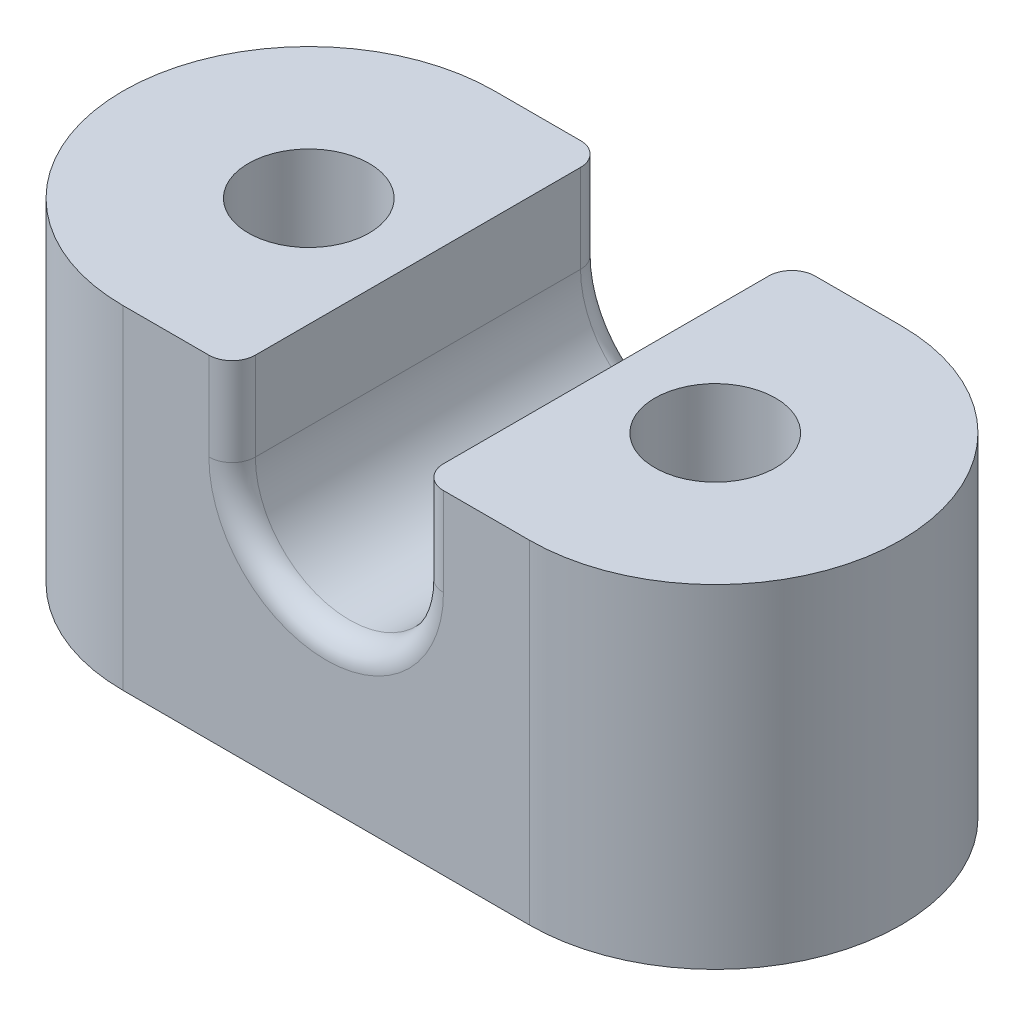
ISO-10303-21;
HEADER;
FILE_DESCRIPTION(('STEP AP214'),'2;1');
FILE_NAME('part.step','',(''),(''),'','','');
FILE_SCHEMA(('AUTOMOTIVE_DESIGN { 1 0 10303 214 1 1 1 1 }'));
ENDSEC;
DATA;
#1=APPLICATION_CONTEXT('core data for automotive mechanical design processes');
#2=APPLICATION_PROTOCOL_DEFINITION('international standard','automotive_design',2000,#1);
#3=PRODUCT_CONTEXT('',#1,'mechanical');
#4=PRODUCT('Part','Part','',(#3));
#5=PRODUCT_RELATED_PRODUCT_CATEGORY('part','',(#4));
#6=PRODUCT_DEFINITION_FORMATION('','',#4);
#7=PRODUCT_DEFINITION_CONTEXT('part definition',#1,'design');
#8=PRODUCT_DEFINITION('design','',#6,#7);
#9=PRODUCT_DEFINITION_SHAPE('','',#8);
#10=(LENGTH_UNIT() NAMED_UNIT(*) SI_UNIT(.MILLI.,.METRE.));
#11=(NAMED_UNIT(*) PLANE_ANGLE_UNIT() SI_UNIT($,.RADIAN.));
#12=(NAMED_UNIT(*) SI_UNIT($,.STERADIAN.) SOLID_ANGLE_UNIT());
#13=UNCERTAINTY_MEASURE_WITH_UNIT(LENGTH_MEASURE(1.E-05),#10,'distance_accuracy_value','');
#14=(GEOMETRIC_REPRESENTATION_CONTEXT(3) GLOBAL_UNCERTAINTY_ASSIGNED_CONTEXT((#13)) GLOBAL_UNIT_ASSIGNED_CONTEXT((#10,
#11,#12)) REPRESENTATION_CONTEXT('',''));
#15=CARTESIAN_POINT('',(0.,0.,0.));
#16=DIRECTION('',(0.,0.,1.));
#17=DIRECTION('',(1.,0.,0.));
#18=AXIS2_PLACEMENT_3D('',#15,#16,#17);
#19=CARTESIAN_POINT('',(-61.2681475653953,14.35,0.));
#20=DIRECTION('',(0.,1.,0.));
#21=DIRECTION('',(0.,0.,1.));
#22=AXIS2_PLACEMENT_3D('',#19,#20,#21);
#23=PLANE('',#22);
#24=DIRECTION('',(0.,0.,-1.));
#25=VECTOR('',#24,1.);
#26=CARTESIAN_POINT('',(-48.4681475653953,14.35,0.));
#27=LINE('',#26,#25);
#28=CARTESIAN_POINT('',(-48.4681475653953,14.35,7.));
#29=VERTEX_POINT('',#28);
#30=CARTESIAN_POINT('',(-48.4681475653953,14.35,-7.));
#31=VERTEX_POINT('',#30);
#32=EDGE_CURVE('E153',#29,#31,#27,.T.);
#33=ORIENTED_EDGE('',*,*,#32,.F.);
#34=CARTESIAN_POINT('',(-47.4681475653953,14.35,7.));
#35=DIRECTION('',(0.,1.,0.));
#36=DIRECTION('',(0.,0.,1.));
#37=AXIS2_PLACEMENT_3D('',#34,#35,#36);
#38=CIRCLE('',#37,1.);
#39=CARTESIAN_POINT('',(-47.4681475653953,14.35,8.));
#40=VERTEX_POINT('',#39);
#41=EDGE_CURVE('E205',#29,#40,#38,.T.);
#42=ORIENTED_EDGE('',*,*,#41,.T.);
#43=DIRECTION('',(1.,0.,0.));
#44=VECTOR('',#43,1.);
#45=CARTESIAN_POINT('',(-61.2681475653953,14.35,8.));
#46=LINE('',#45,#44);
#47=CARTESIAN_POINT('',(-43.7681475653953,14.35,8.));
#48=VERTEX_POINT('',#47);
#49=EDGE_CURVE('E134',#40,#48,#46,.T.);
#50=ORIENTED_EDGE('',*,*,#49,.T.);
#51=CARTESIAN_POINT('',(-43.7681475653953,14.35,0.));
#52=DIRECTION('',(0.,1.,0.));
#53=DIRECTION('',(0.,0.,1.));
#54=AXIS2_PLACEMENT_3D('',#51,#52,#53);
#55=CIRCLE('',#54,8.);
#56=CARTESIAN_POINT('',(-43.7681475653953,14.35,-8.));
#57=VERTEX_POINT('',#56);
#58=EDGE_CURVE('E133',#48,#57,#55,.T.);
#59=ORIENTED_EDGE('',*,*,#58,.T.);
#60=DIRECTION('',(-1.,0.,0.));
#61=VECTOR('',#60,1.);
#62=CARTESIAN_POINT('',(-61.2681475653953,14.35,-8.));
#63=LINE('',#62,#61);
#64=CARTESIAN_POINT('',(-47.4681475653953,14.35,-8.));
#65=VERTEX_POINT('',#64);
#66=EDGE_CURVE('E283',#57,#65,#63,.T.);
#67=ORIENTED_EDGE('',*,*,#66,.T.);
#68=CARTESIAN_POINT('',(-47.4681475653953,14.35,-7.));
#69=DIRECTION('',(0.,1.,0.));
#70=DIRECTION('',(0.,0.,1.));
#71=AXIS2_PLACEMENT_3D('',#68,#69,#70);
#72=CIRCLE('',#71,1.);
#73=EDGE_CURVE('E180',#65,#31,#72,.T.);
#74=ORIENTED_EDGE('',*,*,#73,.T.);
#75=EDGE_LOOP('',(#33,#42,#50,#59,#67,#74));
#76=FACE_BOUND('',#75,.T.);
#77=CARTESIAN_POINT('',(-43.7681475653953,14.35,0.));
#78=DIRECTION('',(0.,-1.,0.));
#79=DIRECTION('',(0.,0.,-1.));
#80=AXIS2_PLACEMENT_3D('',#77,#78,#79);
#81=CIRCLE('',#80,2.6);
#82=CARTESIAN_POINT('',(-43.7681475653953,14.35,-2.6));
#83=VERTEX_POINT('',#82);
#84=EDGE_CURVE('E163',#83,#83,#81,.T.);
#85=ORIENTED_EDGE('',*,*,#84,.T.);
#86=EDGE_LOOP('',(#85));
#87=FACE_BOUND('',#86,.T.);
#88=ADVANCED_FACE('F35',(#76,#87),#23,.T.);
#89=CARTESIAN_POINT('',(-61.2681475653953,14.35,0.));
#90=DIRECTION('',(0.,-1.,0.));
#91=DIRECTION('',(0.,0.,-1.));
#92=AXIS2_PLACEMENT_3D('',#89,#90,#91);
#93=CYLINDRICAL_SURFACE('',#92,2.6);
#94=CARTESIAN_POINT('',(-61.2681475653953,14.35,0.));
#95=DIRECTION('',(0.,-1.,0.));
#96=DIRECTION('',(0.,0.,-1.));
#97=AXIS2_PLACEMENT_3D('',#94,#95,#96);
#98=CIRCLE('',#97,2.6);
#99=CARTESIAN_POINT('',(-61.2681475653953,14.35,-2.6));
#100=VERTEX_POINT('',#99);
#101=EDGE_CURVE('E289',#100,#100,#98,.T.);
#102=ORIENTED_EDGE('',*,*,#101,.F.);
#103=EDGE_LOOP('',(#102));
#104=FACE_BOUND('',#103,.T.);
#105=CARTESIAN_POINT('',(-61.2681475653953,4.,0.));
#106=DIRECTION('',(0.,-1.,0.));
#107=DIRECTION('',(0.,0.,-1.));
#108=AXIS2_PLACEMENT_3D('',#105,#106,#107);
#109=CIRCLE('',#108,2.6);
#110=CARTESIAN_POINT('',(-61.2681475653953,4.,-2.6));
#111=VERTEX_POINT('',#110);
#112=EDGE_CURVE('E165',#111,#111,#109,.F.);
#113=ORIENTED_EDGE('',*,*,#112,.F.);
#114=EDGE_LOOP('',(#113));
#115=FACE_BOUND('',#114,.T.);
#116=ADVANCED_FACE('F232',(#104,#115),#93,.F.);
#117=CARTESIAN_POINT('',(-43.7681475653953,14.35,0.));
#118=DIRECTION('',(0.,-1.,0.));
#119=DIRECTION('',(0.,0.,-1.));
#120=AXIS2_PLACEMENT_3D('',#117,#118,#119);
#121=CYLINDRICAL_SURFACE('',#120,2.6);
#122=ORIENTED_EDGE('',*,*,#84,.F.);
#123=EDGE_LOOP('',(#122));
#124=FACE_BOUND('',#123,.T.);
#125=CARTESIAN_POINT('',(-43.7681475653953,4.,0.));
#126=DIRECTION('',(0.,-1.,0.));
#127=DIRECTION('',(0.,0.,-1.));
#128=AXIS2_PLACEMENT_3D('',#125,#126,#127);
#129=CIRCLE('',#128,2.6);
#130=CARTESIAN_POINT('',(-43.7681475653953,4.,-2.6));
#131=VERTEX_POINT('',#130);
#132=EDGE_CURVE('E160',#131,#131,#129,.F.);
#133=ORIENTED_EDGE('',*,*,#132,.F.);
#134=EDGE_LOOP('',(#133));
#135=FACE_BOUND('',#134,.T.);
#136=ADVANCED_FACE('F238',(#124,#135),#121,.F.);
#137=CARTESIAN_POINT('',(-61.2681475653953,14.35,0.));
#138=DIRECTION('',(0.,-1.,0.));
#139=DIRECTION('',(0.,0.,-1.));
#140=AXIS2_PLACEMENT_3D('',#137,#138,#139);
#141=CYLINDRICAL_SURFACE('',#140,8.);
#142=CARTESIAN_POINT('',(-61.2681475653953,0.,0.));
#143=DIRECTION('',(0.,1.,0.));
#144=DIRECTION('',(0.,0.,1.));
#145=AXIS2_PLACEMENT_3D('',#142,#143,#144);
#146=CIRCLE('',#145,8.);
#147=CARTESIAN_POINT('',(-61.2681475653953,0.,-8.));
#148=VERTEX_POINT('',#147);
#149=CARTESIAN_POINT('',(-61.2681475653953,0.,8.));
#150=VERTEX_POINT('',#149);
#151=EDGE_CURVE('E149',#148,#150,#146,.T.);
#152=ORIENTED_EDGE('',*,*,#151,.T.);
#153=DIRECTION('',(0.,-1.,0.));
#154=VECTOR('',#153,1.);
#155=CARTESIAN_POINT('',(-61.2681475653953,14.35,8.));
#156=LINE('',#155,#154);
#157=CARTESIAN_POINT('',(-61.2681475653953,14.35,8.));
#158=VERTEX_POINT('',#157);
#159=EDGE_CURVE('E129',#158,#150,#156,.T.);
#160=ORIENTED_EDGE('',*,*,#159,.F.);
#161=CARTESIAN_POINT('',(-61.2681475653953,14.35,0.));
#162=DIRECTION('',(0.,1.,0.));
#163=DIRECTION('',(0.,0.,1.));
#164=AXIS2_PLACEMENT_3D('',#161,#162,#163);
#165=CIRCLE('',#164,8.);
#166=CARTESIAN_POINT('',(-61.2681475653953,14.35,-8.));
#167=VERTEX_POINT('',#166);
#168=EDGE_CURVE('E137',#167,#158,#165,.T.);
#169=ORIENTED_EDGE('',*,*,#168,.F.);
#170=DIRECTION('',(0.,-1.,0.));
#171=VECTOR('',#170,1.);
#172=CARTESIAN_POINT('',(-61.2681475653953,14.35,-8.));
#173=LINE('',#172,#171);
#174=EDGE_CURVE('E286',#167,#148,#173,.T.);
#175=ORIENTED_EDGE('',*,*,#174,.T.);
#176=EDGE_LOOP('',(#152,#160,#169,#175));
#177=FACE_BOUND('',#176,.T.);
#178=ADVANCED_FACE('F147',(#177),#141,.T.);
#179=CARTESIAN_POINT('',(-61.2681475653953,14.35,8.));
#180=DIRECTION('',(0.,0.,-1.));
#181=DIRECTION('',(-1.,0.,0.));
#182=AXIS2_PLACEMENT_3D('',#179,#180,#181);
#183=PLANE('',#182);
#184=ORIENTED_EDGE('',*,*,#49,.F.);
#185=DIRECTION('',(0.,-1.,0.));
#186=VECTOR('',#185,1.);
#187=CARTESIAN_POINT('',(-47.4681475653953,14.35,8.));
#188=LINE('',#187,#186);
#189=CARTESIAN_POINT('',(-47.4681475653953,10.55,8.));
#190=VERTEX_POINT('',#189);
#191=EDGE_CURVE('E200',#40,#190,#188,.T.);
#192=ORIENTED_EDGE('',*,*,#191,.T.);
#193=CARTESIAN_POINT('',(-52.5181475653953,10.55,8.));
#194=DIRECTION('',(0.,0.,-1.));
#195=DIRECTION('',(-1.,0.,0.));
#196=AXIS2_PLACEMENT_3D('',#193,#194,#195);
#197=CIRCLE('',#196,5.05);
#198=CARTESIAN_POINT('',(-57.5681475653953,10.55,8.));
#199=VERTEX_POINT('',#198);
#200=EDGE_CURVE('E198',#190,#199,#197,.T.);
#201=ORIENTED_EDGE('',*,*,#200,.T.);
#202=DIRECTION('',(0.,1.,0.));
#203=VECTOR('',#202,1.);
#204=CARTESIAN_POINT('',(-57.5681475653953,14.35,8.));
#205=LINE('',#204,#203);
#206=CARTESIAN_POINT('',(-57.5681475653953,14.35,8.));
#207=VERTEX_POINT('',#206);
#208=EDGE_CURVE('E132',#199,#207,#205,.T.);
#209=ORIENTED_EDGE('',*,*,#208,.T.);
#210=EDGE_CURVE('E124',#158,#207,#46,.T.);
#211=ORIENTED_EDGE('',*,*,#210,.F.);
#212=ORIENTED_EDGE('',*,*,#159,.T.);
#213=DIRECTION('',(1.,0.,0.));
#214=VECTOR('',#213,1.);
#215=CARTESIAN_POINT('',(-61.2681475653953,0.,8.));
#216=LINE('',#215,#214);
#217=CARTESIAN_POINT('',(-43.7681475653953,0.,8.));
#218=VERTEX_POINT('',#217);
#219=EDGE_CURVE('E288',#150,#218,#216,.T.);
#220=ORIENTED_EDGE('',*,*,#219,.T.);
#221=DIRECTION('',(0.,-1.,0.));
#222=VECTOR('',#221,1.);
#223=CARTESIAN_POINT('',(-43.7681475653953,14.35,8.));
#224=LINE('',#223,#222);
#225=EDGE_CURVE('E151',#48,#218,#224,.T.);
#226=ORIENTED_EDGE('',*,*,#225,.F.);
#227=EDGE_LOOP('',(#184,#192,#201,#209,#211,#212,#220,#226));
#228=FACE_BOUND('',#227,.T.);
#229=ADVANCED_FACE('F127',(#228),#183,.F.);
#230=CARTESIAN_POINT('',(-43.7681475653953,14.35,0.));
#231=DIRECTION('',(0.,-1.,0.));
#232=DIRECTION('',(0.,0.,-1.));
#233=AXIS2_PLACEMENT_3D('',#230,#231,#232);
#234=CYLINDRICAL_SURFACE('',#233,8.);
#235=CARTESIAN_POINT('',(-43.7681475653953,0.,0.));
#236=DIRECTION('',(0.,1.,0.));
#237=DIRECTION('',(0.,0.,1.));
#238=AXIS2_PLACEMENT_3D('',#235,#236,#237);
#239=CIRCLE('',#238,8.);
#240=CARTESIAN_POINT('',(-43.7681475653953,0.,-8.));
#241=VERTEX_POINT('',#240);
#242=EDGE_CURVE('E291',#218,#241,#239,.T.);
#243=ORIENTED_EDGE('',*,*,#242,.T.);
#244=DIRECTION('',(0.,-1.,0.));
#245=VECTOR('',#244,1.);
#246=CARTESIAN_POINT('',(-43.7681475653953,14.35,-8.));
#247=LINE('',#246,#245);
#248=EDGE_CURVE('E156',#57,#241,#247,.T.);
#249=ORIENTED_EDGE('',*,*,#248,.F.);
#250=ORIENTED_EDGE('',*,*,#58,.F.);
#251=ORIENTED_EDGE('',*,*,#225,.T.);
#252=EDGE_LOOP('',(#243,#249,#250,#251));
#253=FACE_BOUND('',#252,.T.);
#254=ADVANCED_FACE('F253',(#253),#234,.T.);
#255=CARTESIAN_POINT('',(-61.2681475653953,14.35,-8.));
#256=DIRECTION('',(0.,0.,1.));
#257=DIRECTION('',(1.,0.,0.));
#258=AXIS2_PLACEMENT_3D('',#255,#256,#257);
#259=PLANE('',#258);
#260=CARTESIAN_POINT('',(-52.5181475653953,10.55,-8.));
#261=DIRECTION('',(0.,0.,1.));
#262=DIRECTION('',(1.,0.,0.));
#263=AXIS2_PLACEMENT_3D('',#260,#261,#262);
#264=CIRCLE('',#263,5.05);
#265=CARTESIAN_POINT('',(-57.5681475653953,10.55,-8.));
#266=VERTEX_POINT('',#265);
#267=CARTESIAN_POINT('',(-47.4681475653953,10.55,-8.));
#268=VERTEX_POINT('',#267);
#269=EDGE_CURVE('E174',#266,#268,#264,.T.);
#270=ORIENTED_EDGE('',*,*,#269,.T.);
#271=DIRECTION('',(0.,-1.,0.));
#272=VECTOR('',#271,1.);
#273=CARTESIAN_POINT('',(-47.4681475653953,14.35,-8.));
#274=LINE('',#273,#272);
#275=EDGE_CURVE('E178',#268,#65,#274,.F.);
#276=ORIENTED_EDGE('',*,*,#275,.T.);
#277=ORIENTED_EDGE('',*,*,#66,.F.);
#278=ORIENTED_EDGE('',*,*,#248,.T.);
#279=DIRECTION('',(-1.,0.,0.));
#280=VECTOR('',#279,1.);
#281=CARTESIAN_POINT('',(-61.2681475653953,0.,-8.));
#282=LINE('',#281,#280);
#283=EDGE_CURVE('E145',#241,#148,#282,.T.);
#284=ORIENTED_EDGE('',*,*,#283,.T.);
#285=ORIENTED_EDGE('',*,*,#174,.F.);
#286=CARTESIAN_POINT('',(-57.5681475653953,14.35,-8.));
#287=VERTEX_POINT('',#286);
#288=EDGE_CURVE('E141',#287,#167,#63,.T.);
#289=ORIENTED_EDGE('',*,*,#288,.F.);
#290=DIRECTION('',(0.,1.,0.));
#291=VECTOR('',#290,1.);
#292=CARTESIAN_POINT('',(-57.5681475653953,14.35,-8.));
#293=LINE('',#292,#291);
#294=EDGE_CURVE('E176',#287,#266,#293,.F.);
#295=ORIENTED_EDGE('',*,*,#294,.T.);
#296=EDGE_LOOP('',(#270,#276,#277,#278,#284,#285,#289,#295));
#297=FACE_BOUND('',#296,.T.);
#298=ADVANCED_FACE('F246',(#297),#259,.F.);
#299=ORIENTED_EDGE('',*,*,#210,.T.);
#300=CARTESIAN_POINT('',(-57.5681475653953,14.35,7.));
#301=DIRECTION('',(0.,1.,0.));
#302=DIRECTION('',(0.,0.,1.));
#303=AXIS2_PLACEMENT_3D('',#300,#301,#302);
#304=CIRCLE('',#303,1.);
#305=CARTESIAN_POINT('',(-56.5681475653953,14.35,7.));
#306=VERTEX_POINT('',#305);
#307=EDGE_CURVE('E44',#207,#306,#304,.T.);
#308=ORIENTED_EDGE('',*,*,#307,.T.);
#309=DIRECTION('',(0.,0.,1.));
#310=VECTOR('',#309,1.);
#311=CARTESIAN_POINT('',(-56.5681475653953,14.35,0.));
#312=LINE('',#311,#310);
#313=CARTESIAN_POINT('',(-56.5681475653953,14.35,-7.));
#314=VERTEX_POINT('',#313);
#315=EDGE_CURVE('E150',#314,#306,#312,.T.);
#316=ORIENTED_EDGE('',*,*,#315,.F.);
#317=CARTESIAN_POINT('',(-57.5681475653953,14.35,-7.));
#318=DIRECTION('',(0.,1.,0.));
#319=DIRECTION('',(0.,0.,1.));
#320=AXIS2_PLACEMENT_3D('',#317,#318,#319);
#321=CIRCLE('',#320,1.);
#322=EDGE_CURVE('E185',#314,#287,#321,.T.);
#323=ORIENTED_EDGE('',*,*,#322,.T.);
#324=ORIENTED_EDGE('',*,*,#288,.T.);
#325=ORIENTED_EDGE('',*,*,#168,.T.);
#326=EDGE_LOOP('',(#299,#308,#316,#323,#324,#325));
#327=FACE_BOUND('',#326,.T.);
#328=ORIENTED_EDGE('',*,*,#101,.T.);
#329=EDGE_LOOP('',(#328));
#330=FACE_BOUND('',#329,.T.);
#331=ADVANCED_FACE('F138',(#327,#330),#23,.T.);
#332=CARTESIAN_POINT('',(-61.2681475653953,0.,0.));
#333=DIRECTION('',(0.,1.,0.));
#334=DIRECTION('',(0.,0.,1.));
#335=AXIS2_PLACEMENT_3D('',#332,#333,#334);
#336=PLANE('',#335);
#337=CARTESIAN_POINT('',(-61.2681475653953,0.,0.));
#338=DIRECTION('',(0.,-1.,0.));
#339=DIRECTION('',(0.,0.,-1.));
#340=AXIS2_PLACEMENT_3D('',#337,#338,#339);
#341=CIRCLE('',#340,4.25000000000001);
#342=CARTESIAN_POINT('',(-61.2681475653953,0.,-4.25000000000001));
#343=VERTEX_POINT('',#342);
#344=EDGE_CURVE('E310',#343,#343,#341,.T.);
#345=ORIENTED_EDGE('',*,*,#344,.F.);
#346=EDGE_LOOP('',(#345));
#347=FACE_BOUND('',#346,.T.);
#348=CARTESIAN_POINT('',(-43.7681475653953,0.,0.));
#349=DIRECTION('',(0.,-1.,0.));
#350=DIRECTION('',(0.,0.,-1.));
#351=AXIS2_PLACEMENT_3D('',#348,#349,#350);
#352=CIRCLE('',#351,4.25000000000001);
#353=CARTESIAN_POINT('',(-43.7681475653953,0.,-4.25000000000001));
#354=VERTEX_POINT('',#353);
#355=EDGE_CURVE('E167',#354,#354,#352,.T.);
#356=ORIENTED_EDGE('',*,*,#355,.F.);
#357=EDGE_LOOP('',(#356));
#358=FACE_BOUND('',#357,.T.);
#359=ORIENTED_EDGE('',*,*,#151,.F.);
#360=ORIENTED_EDGE('',*,*,#283,.F.);
#361=ORIENTED_EDGE('',*,*,#242,.F.);
#362=ORIENTED_EDGE('',*,*,#219,.F.);
#363=EDGE_LOOP('',(#359,#360,#361,#362));
#364=FACE_BOUND('',#363,.T.);
#365=ADVANCED_FACE('F245',(#347,#358,#364),#336,.F.);
#366=CARTESIAN_POINT('',(-43.7681475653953,4.,0.));
#367=DIRECTION('',(0.,-1.,0.));
#368=DIRECTION('',(0.,0.,-1.));
#369=AXIS2_PLACEMENT_3D('',#366,#367,#368);
#370=PLANE('',#369);
#371=CARTESIAN_POINT('',(-43.7681475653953,4.,0.));
#372=DIRECTION('',(0.,-1.,0.));
#373=DIRECTION('',(0.,0.,-1.));
#374=AXIS2_PLACEMENT_3D('',#371,#372,#373);
#375=CIRCLE('',#374,4.25000000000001);
#376=CARTESIAN_POINT('',(-43.7681475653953,4.,-4.25000000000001));
#377=VERTEX_POINT('',#376);
#378=EDGE_CURVE('E164',#377,#377,#375,.T.);
#379=ORIENTED_EDGE('',*,*,#378,.T.);
#380=EDGE_LOOP('',(#379));
#381=FACE_BOUND('',#380,.T.);
#382=ORIENTED_EDGE('',*,*,#132,.T.);
#383=EDGE_LOOP('',(#382));
#384=FACE_BOUND('',#383,.T.);
#385=ADVANCED_FACE('F251',(#381,#384),#370,.T.);
#386=CARTESIAN_POINT('',(-43.7681475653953,4.,0.));
#387=DIRECTION('',(0.,-1.,0.));
#388=DIRECTION('',(0.,0.,-1.));
#389=AXIS2_PLACEMENT_3D('',#386,#387,#388);
#390=CYLINDRICAL_SURFACE('',#389,4.25000000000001);
#391=ORIENTED_EDGE('',*,*,#378,.F.);
#392=EDGE_LOOP('',(#391));
#393=FACE_BOUND('',#392,.T.);
#394=ORIENTED_EDGE('',*,*,#355,.T.);
#395=EDGE_LOOP('',(#394));
#396=FACE_BOUND('',#395,.T.);
#397=ADVANCED_FACE('F331',(#393,#396),#390,.F.);
#398=CARTESIAN_POINT('',(-61.2681475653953,4.,0.));
#399=DIRECTION('',(0.,-1.,0.));
#400=DIRECTION('',(0.,0.,-1.));
#401=AXIS2_PLACEMENT_3D('',#398,#399,#400);
#402=PLANE('',#401);
#403=CARTESIAN_POINT('',(-61.2681475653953,4.,0.));
#404=DIRECTION('',(0.,-1.,0.));
#405=DIRECTION('',(0.,0.,-1.));
#406=AXIS2_PLACEMENT_3D('',#403,#404,#405);
#407=CIRCLE('',#406,4.25000000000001);
#408=CARTESIAN_POINT('',(-61.2681475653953,4.,-4.25000000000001));
#409=VERTEX_POINT('',#408);
#410=EDGE_CURVE('E168',#409,#409,#407,.T.);
#411=ORIENTED_EDGE('',*,*,#410,.T.);
#412=EDGE_LOOP('',(#411));
#413=FACE_BOUND('',#412,.T.);
#414=ORIENTED_EDGE('',*,*,#112,.T.);
#415=EDGE_LOOP('',(#414));
#416=FACE_BOUND('',#415,.T.);
#417=ADVANCED_FACE('F328',(#413,#416),#402,.T.);
#418=CARTESIAN_POINT('',(-61.2681475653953,4.,0.));
#419=DIRECTION('',(0.,-1.,0.));
#420=DIRECTION('',(0.,0.,-1.));
#421=AXIS2_PLACEMENT_3D('',#418,#419,#420);
#422=CYLINDRICAL_SURFACE('',#421,4.25000000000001);
#423=ORIENTED_EDGE('',*,*,#410,.F.);
#424=EDGE_LOOP('',(#423));
#425=FACE_BOUND('',#424,.T.);
#426=ORIENTED_EDGE('',*,*,#344,.T.);
#427=EDGE_LOOP('',(#426));
#428=FACE_BOUND('',#427,.T.);
#429=ADVANCED_FACE('F330',(#425,#428),#422,.F.);
#430=CARTESIAN_POINT('',(-52.5181475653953,10.55,8.));
#431=DIRECTION('',(0.,0.,-1.));
#432=DIRECTION('',(-1.,0.,0.));
#433=AXIS2_PLACEMENT_3D('',#430,#431,#432);
#434=CYLINDRICAL_SURFACE('',#433,4.05);
#435=DIRECTION('',(0.,0.,-1.));
#436=VECTOR('',#435,1.);
#437=CARTESIAN_POINT('',(-56.5681475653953,10.55,8.));
#438=LINE('',#437,#436);
#439=CARTESIAN_POINT('',(-56.5681475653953,10.55,7.));
#440=VERTEX_POINT('',#439);
#441=CARTESIAN_POINT('',(-56.5681475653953,10.55,-7.));
#442=VERTEX_POINT('',#441);
#443=EDGE_CURVE('E196',#440,#442,#438,.T.);
#444=ORIENTED_EDGE('',*,*,#443,.F.);
#445=CARTESIAN_POINT('',(-52.5181475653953,10.55,7.));
#446=DIRECTION('',(0.,0.,-1.));
#447=DIRECTION('',(-1.,0.,0.));
#448=AXIS2_PLACEMENT_3D('',#445,#446,#447);
#449=CIRCLE('',#448,4.05);
#450=CARTESIAN_POINT('',(-48.4681475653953,10.55,7.));
#451=VERTEX_POINT('',#450);
#452=EDGE_CURVE('E207',#440,#451,#449,.F.);
#453=ORIENTED_EDGE('',*,*,#452,.T.);
#454=DIRECTION('',(0.,0.,-1.));
#455=VECTOR('',#454,1.);
#456=CARTESIAN_POINT('',(-48.4681475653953,10.55,8.));
#457=LINE('',#456,#455);
#458=CARTESIAN_POINT('',(-48.4681475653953,10.55,-7.));
#459=VERTEX_POINT('',#458);
#460=EDGE_CURVE('E308',#451,#459,#457,.T.);
#461=ORIENTED_EDGE('',*,*,#460,.T.);
#462=CARTESIAN_POINT('',(-52.5181475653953,10.55,-7.));
#463=DIRECTION('',(0.,0.,1.));
#464=DIRECTION('',(1.,0.,0.));
#465=AXIS2_PLACEMENT_3D('',#462,#463,#464);
#466=CIRCLE('',#465,4.05);
#467=EDGE_CURVE('E187',#459,#442,#466,.F.);
#468=ORIENTED_EDGE('',*,*,#467,.T.);
#469=EDGE_LOOP('',(#444,#453,#461,#468));
#470=FACE_BOUND('',#469,.T.);
#471=ADVANCED_FACE('F338',(#470),#434,.F.);
#472=CARTESIAN_POINT('',(-48.4681475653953,10.55,8.));
#473=DIRECTION('',(1.,0.,0.));
#474=DIRECTION('',(0.,0.,-1.));
#475=AXIS2_PLACEMENT_3D('',#472,#473,#474);
#476=PLANE('',#475);
#477=ORIENTED_EDGE('',*,*,#460,.F.);
#478=DIRECTION('',(0.,-1.,0.));
#479=VECTOR('',#478,1.);
#480=CARTESIAN_POINT('',(-48.4681475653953,10.55,7.));
#481=LINE('',#480,#479);
#482=EDGE_CURVE('E203',#451,#29,#481,.F.);
#483=ORIENTED_EDGE('',*,*,#482,.T.);
#484=ORIENTED_EDGE('',*,*,#32,.T.);
#485=DIRECTION('',(0.,-1.,0.));
#486=VECTOR('',#485,1.);
#487=CARTESIAN_POINT('',(-48.4681475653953,10.55,-7.));
#488=LINE('',#487,#486);
#489=EDGE_CURVE('E171',#31,#459,#488,.T.);
#490=ORIENTED_EDGE('',*,*,#489,.T.);
#491=EDGE_LOOP('',(#477,#483,#484,#490));
#492=FACE_BOUND('',#491,.T.);
#493=ADVANCED_FACE('F307',(#492),#476,.F.);
#494=CARTESIAN_POINT('',(-56.5681475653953,10.55,8.));
#495=DIRECTION('',(-1.,0.,0.));
#496=DIRECTION('',(0.,0.,1.));
#497=AXIS2_PLACEMENT_3D('',#494,#495,#496);
#498=PLANE('',#497);
#499=ORIENTED_EDGE('',*,*,#315,.T.);
#500=DIRECTION('',(0.,1.,0.));
#501=VECTOR('',#500,1.);
#502=CARTESIAN_POINT('',(-56.5681475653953,10.55,7.));
#503=LINE('',#502,#501);
#504=EDGE_CURVE('E11',#306,#440,#503,.F.);
#505=ORIENTED_EDGE('',*,*,#504,.T.);
#506=ORIENTED_EDGE('',*,*,#443,.T.);
#507=DIRECTION('',(0.,1.,0.));
#508=VECTOR('',#507,1.);
#509=CARTESIAN_POINT('',(-56.5681475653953,10.55,-7.));
#510=LINE('',#509,#508);
#511=EDGE_CURVE('E183',#442,#314,#510,.T.);
#512=ORIENTED_EDGE('',*,*,#511,.T.);
#513=EDGE_LOOP('',(#499,#505,#506,#512));
#514=FACE_BOUND('',#513,.T.);
#515=ADVANCED_FACE('F272',(#514),#498,.F.);
#516=CARTESIAN_POINT('',(-57.5681475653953,10.55,-7.));
#517=DIRECTION('',(0.,1.,0.));
#518=DIRECTION('',(0.,0.,1.));
#519=AXIS2_PLACEMENT_3D('',#516,#517,#518);
#520=CYLINDRICAL_SURFACE('',#519,1.);
#521=ORIENTED_EDGE('',*,*,#322,.F.);
#522=ORIENTED_EDGE('',*,*,#511,.F.);
#523=CARTESIAN_POINT('',(-57.5681475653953,10.55,-7.));
#524=DIRECTION('',(0.,-1.,0.));
#525=DIRECTION('',(0.,0.,-1.));
#526=AXIS2_PLACEMENT_3D('',#523,#524,#525);
#527=CIRCLE('',#526,1.);
#528=EDGE_CURVE('E193',#266,#442,#527,.T.);
#529=ORIENTED_EDGE('',*,*,#528,.F.);
#530=ORIENTED_EDGE('',*,*,#294,.F.);
#531=EDGE_LOOP('',(#521,#522,#529,#530));
#532=FACE_BOUND('',#531,.T.);
#533=ADVANCED_FACE('F268',(#532),#520,.T.);
#534=CARTESIAN_POINT('',(-52.5181475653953,10.55,-7.));
#535=DIRECTION('',(0.,0.,1.));
#536=DIRECTION('',(1.,0.,0.));
#537=AXIS2_PLACEMENT_3D('',#534,#535,#536);
#538=TOROIDAL_SURFACE('',#537,5.05,1.);
#539=ORIENTED_EDGE('',*,*,#528,.T.);
#540=ORIENTED_EDGE('',*,*,#467,.F.);
#541=CARTESIAN_POINT('',(-47.4681475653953,10.55,-7.));
#542=DIRECTION('',(0.,1.,0.));
#543=DIRECTION('',(0.,0.,1.));
#544=AXIS2_PLACEMENT_3D('',#541,#542,#543);
#545=CIRCLE('',#544,1.);
#546=EDGE_CURVE('E190',#268,#459,#545,.T.);
#547=ORIENTED_EDGE('',*,*,#546,.F.);
#548=ORIENTED_EDGE('',*,*,#269,.F.);
#549=EDGE_LOOP('',(#539,#540,#547,#548));
#550=FACE_BOUND('',#549,.T.);
#551=ADVANCED_FACE('F228',(#550),#538,.T.);
#552=CARTESIAN_POINT('',(-47.4681475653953,10.55,-7.));
#553=DIRECTION('',(0.,-1.,0.));
#554=DIRECTION('',(0.,0.,-1.));
#555=AXIS2_PLACEMENT_3D('',#552,#553,#554);
#556=CYLINDRICAL_SURFACE('',#555,1.);
#557=ORIENTED_EDGE('',*,*,#73,.F.);
#558=ORIENTED_EDGE('',*,*,#275,.F.);
#559=ORIENTED_EDGE('',*,*,#546,.T.);
#560=ORIENTED_EDGE('',*,*,#489,.F.);
#561=EDGE_LOOP('',(#557,#558,#559,#560));
#562=FACE_BOUND('',#561,.T.);
#563=ADVANCED_FACE('F222',(#562),#556,.T.);
#564=CARTESIAN_POINT('',(-57.5681475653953,14.35,7.));
#565=DIRECTION('',(0.,1.,0.));
#566=DIRECTION('',(0.,0.,1.));
#567=AXIS2_PLACEMENT_3D('',#564,#565,#566);
#568=CYLINDRICAL_SURFACE('',#567,1.);
#569=ORIENTED_EDGE('',*,*,#307,.F.);
#570=ORIENTED_EDGE('',*,*,#208,.F.);
#571=CARTESIAN_POINT('',(-57.5681475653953,10.55,7.));
#572=DIRECTION('',(0.,-1.,0.));
#573=DIRECTION('',(0.,0.,-1.));
#574=AXIS2_PLACEMENT_3D('',#571,#572,#573);
#575=CIRCLE('',#574,1.);
#576=EDGE_CURVE('E39',#440,#199,#575,.T.);
#577=ORIENTED_EDGE('',*,*,#576,.F.);
#578=ORIENTED_EDGE('',*,*,#504,.F.);
#579=EDGE_LOOP('',(#569,#570,#577,#578));
#580=FACE_BOUND('',#579,.T.);
#581=ADVANCED_FACE('F37',(#580),#568,.T.);
#582=CARTESIAN_POINT('',(-52.5181475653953,10.55,7.));
#583=DIRECTION('',(0.,0.,-1.));
#584=DIRECTION('',(-1.,0.,0.));
#585=AXIS2_PLACEMENT_3D('',#582,#583,#584);
#586=TOROIDAL_SURFACE('',#585,5.05,1.);
#587=ORIENTED_EDGE('',*,*,#576,.T.);
#588=ORIENTED_EDGE('',*,*,#200,.F.);
#589=CARTESIAN_POINT('',(-47.4681475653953,10.55,7.));
#590=DIRECTION('',(0.,1.,0.));
#591=DIRECTION('',(0.,0.,1.));
#592=AXIS2_PLACEMENT_3D('',#589,#590,#591);
#593=CIRCLE('',#592,1.);
#594=EDGE_CURVE('E209',#451,#190,#593,.T.);
#595=ORIENTED_EDGE('',*,*,#594,.F.);
#596=ORIENTED_EDGE('',*,*,#452,.F.);
#597=EDGE_LOOP('',(#587,#588,#595,#596));
#598=FACE_BOUND('',#597,.T.);
#599=ADVANCED_FACE('F219',(#598),#586,.T.);
#600=CARTESIAN_POINT('',(-47.4681475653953,14.35,7.));
#601=DIRECTION('',(0.,-1.,0.));
#602=DIRECTION('',(0.,0.,-1.));
#603=AXIS2_PLACEMENT_3D('',#600,#601,#602);
#604=CYLINDRICAL_SURFACE('',#603,1.);
#605=ORIENTED_EDGE('',*,*,#41,.F.);
#606=ORIENTED_EDGE('',*,*,#482,.F.);
#607=ORIENTED_EDGE('',*,*,#594,.T.);
#608=ORIENTED_EDGE('',*,*,#191,.F.);
#609=EDGE_LOOP('',(#605,#606,#607,#608));
#610=FACE_BOUND('',#609,.T.);
#611=ADVANCED_FACE('F227',(#610),#604,.T.);
#612=CLOSED_SHELL('',(#88,#116,#136,#178,#229,#254,#298,#331,#365,#385,#397,#417,#429,#471,#493,
#515,#533,#551,#563,#581,#599,#611));
#613=MANIFOLD_SOLID_BREP('B2',#612);
#614=ADVANCED_BREP_SHAPE_REPRESENTATION('',(#18,#613),#14);
#615=SHAPE_DEFINITION_REPRESENTATION(#9,#614);
ENDSEC;
END-ISO-10303-21;
